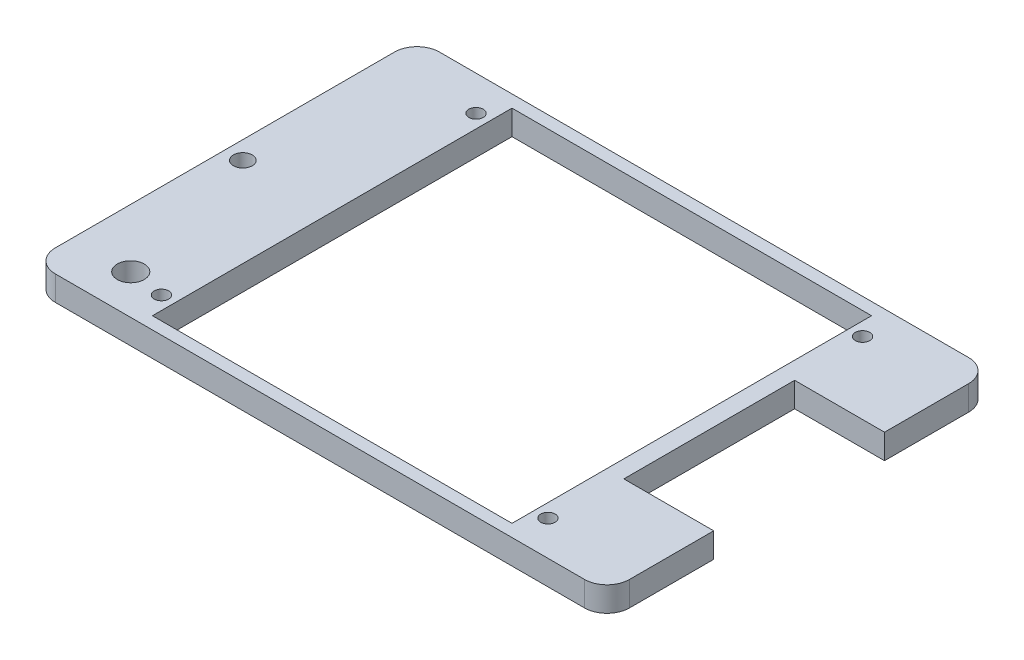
from build123d import *

# Parameters (mm, degrees)
SKETCH1_R           = 2.1
SKETCH1_R_2         = 3
SKETCH1_R_3         = 1.6
BOSS_EXTRUDE1_DEPTH = 5.5
FILLET1_R           = 5
FILLET2_R           = 5


with BuildPart() as part:
    # Sketch1 → Boss-Extrude1 (new body)
    with BuildSketch(Plane(origin=(0, 0, 0), x_dir=(1, 0, 0), z_dir=(0, 1, 0))):
        Polygon((0, 42.74), (63.88, 42.74), (63.88, 19), (43.88, 19), (43.88, 18), (43.88, -18), (43.88, -19), (63.88, -19), (63.88, -42.74), (-63.88, -42.74), (-63.88, -33.941125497), (-63.88, 42.74), align=None)
        with Locations(Location((-59.88, 0, 0), (0, 0, 270))):
            Circle(SKETCH1_R, mode=Mode.SUBTRACT)
        with Locations(Location((-50.88, -33.941125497, 0), (0, 0, 270))):
            Circle(SKETCH1_R_2, mode=Mode.SUBTRACT)
        with Locations(Location((43, 35, 0), (0, 0, 270))):
            Circle(SKETCH1_R_3, mode=Mode.SUBTRACT)
        with Locations(Location((43, -35, 0), (0, 0, 270))):
            Circle(SKETCH1_R_3, mode=Mode.SUBTRACT)
        with Locations(Location((-43, -35, 0), (0, 0, 90))):
            Circle(SKETCH1_R_3, mode=Mode.SUBTRACT)
        with Locations(Location((-43, 35, 0), (0, 0, 90))):
            Circle(SKETCH1_R_3, mode=Mode.SUBTRACT)
        Polygon((0, 40), (40, 40), (40, -40), (-40, -40), (-40, 40), align=None, mode=Mode.SUBTRACT)
    extrude(amount=BOSS_EXTRUDE1_DEPTH)

    # Fillet1
    fillet1_edges = [part.edges().sort_by_distance(p)[0] for p in [
        (-63.88, 2.75, 42.74),
    ]]
    fillet(fillet1_edges, radius=FILLET1_R)

    # Fillet2
    fillet2_edges = [part.edges().sort_by_distance(p)[0] for p in [
        (63.88, 2.75, -42.74),
        (63.88, 2.75, 42.74),
        (-63.88, 2.75, -42.74),
    ]]
    fillet(fillet2_edges, radius=FILLET2_R)


solid = part.part
